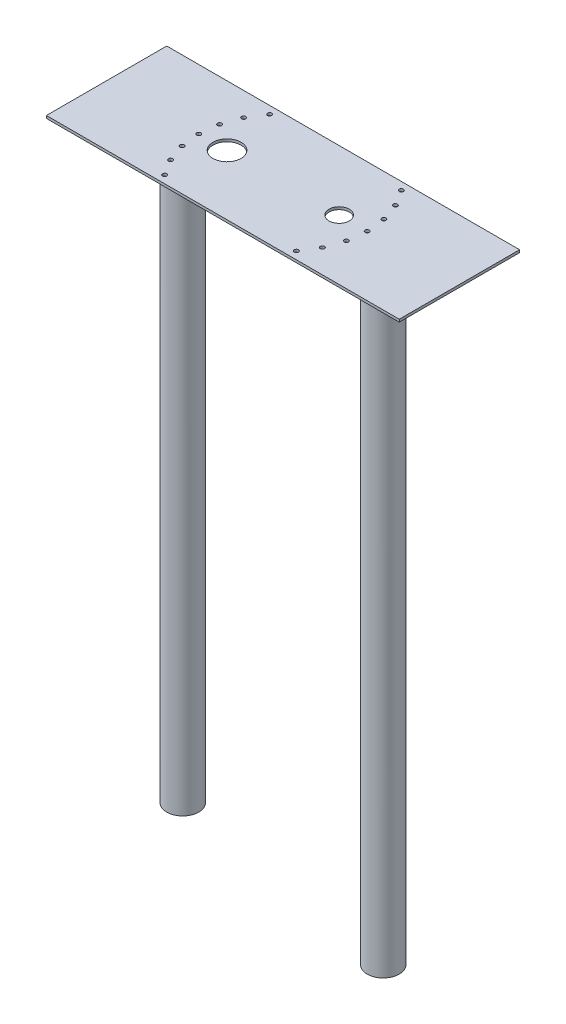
ISO-10303-21;
HEADER;
FILE_DESCRIPTION(('STEP AP214'),'2;1');
FILE_NAME('part.step','',(''),(''),'','','');
FILE_SCHEMA(('AUTOMOTIVE_DESIGN { 1 0 10303 214 1 1 1 1 }'));
ENDSEC;
DATA;
#1=APPLICATION_CONTEXT('core data for automotive mechanical design processes');
#2=APPLICATION_PROTOCOL_DEFINITION('international standard','automotive_design',2000,#1);
#3=PRODUCT_CONTEXT('',#1,'mechanical');
#4=PRODUCT('Part','Part','',(#3));
#5=PRODUCT_RELATED_PRODUCT_CATEGORY('part','',(#4));
#6=PRODUCT_DEFINITION_FORMATION('','',#4);
#7=PRODUCT_DEFINITION_CONTEXT('part definition',#1,'design');
#8=PRODUCT_DEFINITION('design','',#6,#7);
#9=PRODUCT_DEFINITION_SHAPE('','',#8);
#10=(LENGTH_UNIT() NAMED_UNIT(*) SI_UNIT(.MILLI.,.METRE.));
#11=(NAMED_UNIT(*) PLANE_ANGLE_UNIT() SI_UNIT($,.RADIAN.));
#12=(NAMED_UNIT(*) SI_UNIT($,.STERADIAN.) SOLID_ANGLE_UNIT());
#13=UNCERTAINTY_MEASURE_WITH_UNIT(LENGTH_MEASURE(1.E-05),#10,'distance_accuracy_value','');
#14=(GEOMETRIC_REPRESENTATION_CONTEXT(3) GLOBAL_UNCERTAINTY_ASSIGNED_CONTEXT((#13)) GLOBAL_UNIT_ASSIGNED_CONTEXT((#10,
#11,#12)) REPRESENTATION_CONTEXT('',''));
#15=CARTESIAN_POINT('',(0.,0.,0.));
#16=DIRECTION('',(0.,0.,1.));
#17=DIRECTION('',(1.,0.,0.));
#18=AXIS2_PLACEMENT_3D('',#15,#16,#17);
#19=CARTESIAN_POINT('',(0.,0.,0.));
#20=DIRECTION('',(0.,1.,0.));
#21=DIRECTION('',(0.,0.,1.));
#22=AXIS2_PLACEMENT_3D('',#19,#20,#21);
#23=PLANE('',#22);
#24=CARTESIAN_POINT('',(739.9,0.,-100.));
#25=DIRECTION('',(0.,1.,0.));
#26=DIRECTION('',(0.,0.,1.));
#27=AXIS2_PLACEMENT_3D('',#24,#25,#26);
#28=CIRCLE('',#27,40.);
#29=CARTESIAN_POINT('',(739.9,0.,-60.));
#30=VERTEX_POINT('',#29);
#31=EDGE_CURVE('E44',#30,#30,#28,.F.);
#32=ORIENTED_EDGE('',*,*,#31,.F.);
#33=EDGE_LOOP('',(#32));
#34=FACE_BOUND('',#33,.T.);
#35=CARTESIAN_POINT('',(235.215138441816,0.,-196.779396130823));
#36=DIRECTION('',(0.,1.,0.));
#37=DIRECTION('',(0.,0.,1.));
#38=AXIS2_PLACEMENT_3D('',#35,#36,#37);
#39=CIRCLE('',#38,5.25);
#40=CARTESIAN_POINT('',(235.215138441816,0.,-191.529396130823));
#41=VERTEX_POINT('',#40);
#42=EDGE_CURVE('E166',#41,#41,#39,.T.);
#43=ORIENTED_EDGE('',*,*,#42,.T.);
#44=EDGE_LOOP('',(#43));
#45=FACE_BOUND('',#44,.T.);
#46=CARTESIAN_POINT('',(250.746537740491,0.,-241.165585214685));
#47=DIRECTION('',(0.,1.,0.));
#48=DIRECTION('',(0.,0.,1.));
#49=AXIS2_PLACEMENT_3D('',#46,#47,#48);
#50=CIRCLE('',#49,5.25);
#51=CARTESIAN_POINT('',(250.746537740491,0.,-235.915585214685));
#52=VERTEX_POINT('',#51);
#53=EDGE_CURVE('E162',#52,#52,#50,.T.);
#54=ORIENTED_EDGE('',*,*,#53,.T.);
#55=EDGE_LOOP('',(#54));
#56=FACE_BOUND('',#55,.T.);
#57=CARTESIAN_POINT('',(275.765388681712,0.,-280.982858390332));
#58=DIRECTION('',(0.,1.,0.));
#59=DIRECTION('',(0.,0.,1.));
#60=AXIS2_PLACEMENT_3D('',#57,#58,#59);
#61=CIRCLE('',#60,5.25);
#62=CARTESIAN_POINT('',(275.765388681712,0.,-275.732858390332));
#63=VERTEX_POINT('',#62);
#64=EDGE_CURVE('E158',#63,#63,#61,.T.);
#65=ORIENTED_EDGE('',*,*,#64,.T.);
#66=EDGE_LOOP('',(#65));
#67=FACE_BOUND('',#66,.T.);
#68=CARTESIAN_POINT('',(604.134611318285,0.,-280.982858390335));
#69=DIRECTION('',(0.,1.,0.));
#70=DIRECTION('',(0.,0.,1.));
#71=AXIS2_PLACEMENT_3D('',#68,#69,#70);
#72=CIRCLE('',#71,5.25);
#73=CARTESIAN_POINT('',(604.134611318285,0.,-275.732858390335));
#74=VERTEX_POINT('',#73);
#75=EDGE_CURVE('E154',#74,#74,#72,.T.);
#76=ORIENTED_EDGE('',*,*,#75,.T.);
#77=EDGE_LOOP('',(#76));
#78=FACE_BOUND('',#77,.T.);
#79=CARTESIAN_POINT('',(629.153462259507,0.,-241.165585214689));
#80=DIRECTION('',(0.,1.,0.));
#81=DIRECTION('',(0.,0.,1.));
#82=AXIS2_PLACEMENT_3D('',#79,#80,#81);
#83=CIRCLE('',#82,5.25);
#84=CARTESIAN_POINT('',(629.153462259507,0.,-235.915585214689));
#85=VERTEX_POINT('',#84);
#86=EDGE_CURVE('E150',#85,#85,#83,.T.);
#87=ORIENTED_EDGE('',*,*,#86,.T.);
#88=EDGE_LOOP('',(#87));
#89=FACE_BOUND('',#88,.T.);
#90=CARTESIAN_POINT('',(644.684861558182,0.,-196.779396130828));
#91=DIRECTION('',(0.,1.,0.));
#92=DIRECTION('',(0.,0.,1.));
#93=AXIS2_PLACEMENT_3D('',#90,#91,#92);
#94=CIRCLE('',#93,5.25);
#95=CARTESIAN_POINT('',(644.684861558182,0.,-191.529396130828));
#96=VERTEX_POINT('',#95);
#97=EDGE_CURVE('E146',#96,#96,#94,.T.);
#98=ORIENTED_EDGE('',*,*,#97,.T.);
#99=EDGE_LOOP('',(#98));
#100=FACE_BOUND('',#99,.T.);
#101=CARTESIAN_POINT('',(649.95,0.,-150.05));
#102=DIRECTION('',(0.,1.,0.));
#103=DIRECTION('',(0.,0.,1.));
#104=AXIS2_PLACEMENT_3D('',#101,#102,#103);
#105=CIRCLE('',#104,5.25);
#106=CARTESIAN_POINT('',(649.95,0.,-144.8));
#107=VERTEX_POINT('',#106);
#108=EDGE_CURVE('E142',#107,#107,#105,.T.);
#109=ORIENTED_EDGE('',*,*,#108,.T.);
#110=EDGE_LOOP('',(#109));
#111=FACE_BOUND('',#110,.T.);
#112=CARTESIAN_POINT('',(644.684861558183,0.,-103.320603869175));
#113=DIRECTION('',(0.,1.,0.));
#114=DIRECTION('',(0.,0.,1.));
#115=AXIS2_PLACEMENT_3D('',#112,#113,#114);
#116=CIRCLE('',#115,5.25);
#117=CARTESIAN_POINT('',(644.684861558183,0.,-98.0706038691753));
#118=VERTEX_POINT('',#117);
#119=EDGE_CURVE('E138',#118,#118,#116,.T.);
#120=ORIENTED_EDGE('',*,*,#119,.T.);
#121=EDGE_LOOP('',(#120));
#122=FACE_BOUND('',#121,.T.);
#123=CARTESIAN_POINT('',(629.153462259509,0.,-58.934414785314));
#124=DIRECTION('',(0.,1.,0.));
#125=DIRECTION('',(0.,0.,1.));
#126=AXIS2_PLACEMENT_3D('',#123,#124,#125);
#127=CIRCLE('',#126,5.25);
#128=CARTESIAN_POINT('',(629.153462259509,0.,-53.684414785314));
#129=VERTEX_POINT('',#128);
#130=EDGE_CURVE('E134',#129,#129,#127,.T.);
#131=ORIENTED_EDGE('',*,*,#130,.T.);
#132=EDGE_LOOP('',(#131));
#133=FACE_BOUND('',#132,.T.);
#134=CARTESIAN_POINT('',(604.134611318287,0.,-19.1171416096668));
#135=DIRECTION('',(0.,1.,0.));
#136=DIRECTION('',(0.,0.,1.));
#137=AXIS2_PLACEMENT_3D('',#134,#135,#136);
#138=CIRCLE('',#137,5.25);
#139=CARTESIAN_POINT('',(604.134611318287,0.,-13.8671416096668));
#140=VERTEX_POINT('',#139);
#141=EDGE_CURVE('E130',#140,#140,#138,.T.);
#142=ORIENTED_EDGE('',*,*,#141,.T.);
#143=EDGE_LOOP('',(#142));
#144=FACE_BOUND('',#143,.T.);
#145=CARTESIAN_POINT('',(275.765388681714,0.,-19.1171416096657));
#146=DIRECTION('',(0.,1.,0.));
#147=DIRECTION('',(0.,0.,1.));
#148=AXIS2_PLACEMENT_3D('',#145,#146,#147);
#149=CIRCLE('',#148,5.25);
#150=CARTESIAN_POINT('',(275.765388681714,0.,-13.8671416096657));
#151=VERTEX_POINT('',#150);
#152=EDGE_CURVE('E126',#151,#151,#149,.T.);
#153=ORIENTED_EDGE('',*,*,#152,.T.);
#154=EDGE_LOOP('',(#153));
#155=FACE_BOUND('',#154,.T.);
#156=CARTESIAN_POINT('',(250.746537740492,0.,-58.9344147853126));
#157=DIRECTION('',(0.,1.,0.));
#158=DIRECTION('',(0.,0.,1.));
#159=AXIS2_PLACEMENT_3D('',#156,#157,#158);
#160=CIRCLE('',#159,5.25);
#161=CARTESIAN_POINT('',(250.746537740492,0.,-53.6844147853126));
#162=VERTEX_POINT('',#161);
#163=EDGE_CURVE('E122',#162,#162,#160,.T.);
#164=ORIENTED_EDGE('',*,*,#163,.T.);
#165=EDGE_LOOP('',(#164));
#166=FACE_BOUND('',#165,.T.);
#167=CARTESIAN_POINT('',(235.215138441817,0.,-103.320603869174));
#168=DIRECTION('',(0.,1.,0.));
#169=DIRECTION('',(0.,0.,1.));
#170=AXIS2_PLACEMENT_3D('',#167,#168,#169);
#171=CIRCLE('',#170,5.25);
#172=CARTESIAN_POINT('',(235.215138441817,0.,-98.0706038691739));
#173=VERTEX_POINT('',#172);
#174=EDGE_CURVE('E118',#173,#173,#171,.T.);
#175=ORIENTED_EDGE('',*,*,#174,.T.);
#176=EDGE_LOOP('',(#175));
#177=FACE_BOUND('',#176,.T.);
#178=CARTESIAN_POINT('',(229.95,0.,-150.05));
#179=DIRECTION('',(0.,1.,0.));
#180=DIRECTION('',(0.,0.,1.));
#181=AXIS2_PLACEMENT_3D('',#178,#179,#180);
#182=CIRCLE('',#181,5.25);
#183=CARTESIAN_POINT('',(229.95,0.,-144.8));
#184=VERTEX_POINT('',#183);
#185=EDGE_CURVE('E113',#184,#184,#182,.T.);
#186=ORIENTED_EDGE('',*,*,#185,.T.);
#187=EDGE_LOOP('',(#186));
#188=FACE_BOUND('',#187,.T.);
#189=CARTESIAN_POINT('',(580.,0.,-150.));
#190=DIRECTION('',(0.,1.,0.));
#191=DIRECTION('',(0.,0.,1.));
#192=AXIS2_PLACEMENT_3D('',#189,#190,#191);
#193=CIRCLE('',#192,25.4);
#194=CARTESIAN_POINT('',(580.,0.,-124.6));
#195=VERTEX_POINT('',#194);
#196=EDGE_CURVE('E208',#195,#195,#193,.T.);
#197=ORIENTED_EDGE('',*,*,#196,.T.);
#198=EDGE_LOOP('',(#197));
#199=FACE_BOUND('',#198,.T.);
#200=CARTESIAN_POINT('',(300.4,0.,-150.));
#201=DIRECTION('',(0.,1.,0.));
#202=DIRECTION('',(0.,0.,1.));
#203=AXIS2_PLACEMENT_3D('',#200,#201,#202);
#204=CIRCLE('',#203,35.);
#205=CARTESIAN_POINT('',(300.4,0.,-115.));
#206=VERTEX_POINT('',#205);
#207=EDGE_CURVE('E106',#206,#206,#204,.T.);
#208=ORIENTED_EDGE('',*,*,#207,.T.);
#209=EDGE_LOOP('',(#208));
#210=FACE_BOUND('',#209,.T.);
#211=DIRECTION('',(0.,0.,1.));
#212=VECTOR('',#211,1.);
#213=CARTESIAN_POINT('',(0.,0.,-300.1));
#214=LINE('',#213,#212);
#215=CARTESIAN_POINT('',(0.,0.,-300.1));
#216=VERTEX_POINT('',#215);
#217=CARTESIAN_POINT('',(0.,0.,0.));
#218=VERTEX_POINT('',#217);
#219=EDGE_CURVE('E103',#216,#218,#214,.T.);
#220=ORIENTED_EDGE('',*,*,#219,.F.);
#221=DIRECTION('',(-1.,0.,0.));
#222=VECTOR('',#221,1.);
#223=CARTESIAN_POINT('',(879.9,0.,-300.1));
#224=LINE('',#223,#222);
#225=CARTESIAN_POINT('',(879.9,0.,-300.1));
#226=VERTEX_POINT('',#225);
#227=EDGE_CURVE('E75',#226,#216,#224,.T.);
#228=ORIENTED_EDGE('',*,*,#227,.F.);
#229=DIRECTION('',(0.,0.,-1.));
#230=VECTOR('',#229,1.);
#231=CARTESIAN_POINT('',(879.9,0.,0.));
#232=LINE('',#231,#230);
#233=CARTESIAN_POINT('',(879.9,0.,0.));
#234=VERTEX_POINT('',#233);
#235=EDGE_CURVE('E69',#234,#226,#232,.T.);
#236=ORIENTED_EDGE('',*,*,#235,.F.);
#237=DIRECTION('',(1.,0.,0.));
#238=VECTOR('',#237,1.);
#239=CARTESIAN_POINT('',(0.,0.,0.));
#240=LINE('',#239,#238);
#241=EDGE_CURVE('E93',#218,#234,#240,.T.);
#242=ORIENTED_EDGE('',*,*,#241,.F.);
#243=EDGE_LOOP('',(#220,#228,#236,#242));
#244=FACE_BOUND('',#243,.T.);
#245=CARTESIAN_POINT('',(140.,0.,-200.));
#246=DIRECTION('',(0.,1.,0.));
#247=DIRECTION('',(0.,0.,1.));
#248=AXIS2_PLACEMENT_3D('',#245,#246,#247);
#249=CIRCLE('',#248,40.);
#250=CARTESIAN_POINT('',(140.,0.,-160.));
#251=VERTEX_POINT('',#250);
#252=EDGE_CURVE('E11',#251,#251,#249,.F.);
#253=ORIENTED_EDGE('',*,*,#252,.F.);
#254=EDGE_LOOP('',(#253));
#255=FACE_BOUND('',#254,.T.);
#256=ADVANCED_FACE('F35',(#34,#45,#56,#67,#78,#89,#100,#111,#122,#133,#144,#155,#166,#177,#188,
#199,#210,#244,#255),#23,.F.);
#257=CARTESIAN_POINT('',(0.,6.4,-300.1));
#258=DIRECTION('',(1.,0.,0.));
#259=DIRECTION('',(0.,0.,-1.));
#260=AXIS2_PLACEMENT_3D('',#257,#258,#259);
#261=PLANE('',#260);
#262=ORIENTED_EDGE('',*,*,#219,.T.);
#263=DIRECTION('',(0.,-1.,0.));
#264=VECTOR('',#263,1.);
#265=CARTESIAN_POINT('',(0.,6.4,0.));
#266=LINE('',#265,#264);
#267=CARTESIAN_POINT('',(0.,6.4,0.));
#268=VERTEX_POINT('',#267);
#269=EDGE_CURVE('E94',#268,#218,#266,.T.);
#270=ORIENTED_EDGE('',*,*,#269,.F.);
#271=DIRECTION('',(0.,0.,1.));
#272=VECTOR('',#271,1.);
#273=CARTESIAN_POINT('',(0.,6.4,-300.1));
#274=LINE('',#273,#272);
#275=CARTESIAN_POINT('',(0.,6.4,-300.1));
#276=VERTEX_POINT('',#275);
#277=EDGE_CURVE('E88',#276,#268,#274,.T.);
#278=ORIENTED_EDGE('',*,*,#277,.F.);
#279=DIRECTION('',(0.,-1.,0.));
#280=VECTOR('',#279,1.);
#281=CARTESIAN_POINT('',(0.,6.4,-300.1));
#282=LINE('',#281,#280);
#283=EDGE_CURVE('E99',#276,#216,#282,.T.);
#284=ORIENTED_EDGE('',*,*,#283,.T.);
#285=EDGE_LOOP('',(#262,#270,#278,#284));
#286=FACE_BOUND('',#285,.T.);
#287=ADVANCED_FACE('F37',(#286),#261,.F.);
#288=CARTESIAN_POINT('',(0.,6.4,0.));
#289=DIRECTION('',(0.,0.,-1.));
#290=DIRECTION('',(-1.,0.,0.));
#291=AXIS2_PLACEMENT_3D('',#288,#289,#290);
#292=PLANE('',#291);
#293=ORIENTED_EDGE('',*,*,#241,.T.);
#294=DIRECTION('',(0.,-1.,0.));
#295=VECTOR('',#294,1.);
#296=CARTESIAN_POINT('',(879.9,6.4,0.));
#297=LINE('',#296,#295);
#298=CARTESIAN_POINT('',(879.9,6.4,0.));
#299=VERTEX_POINT('',#298);
#300=EDGE_CURVE('E91',#299,#234,#297,.T.);
#301=ORIENTED_EDGE('',*,*,#300,.F.);
#302=DIRECTION('',(1.,0.,0.));
#303=VECTOR('',#302,1.);
#304=CARTESIAN_POINT('',(0.,6.4,0.));
#305=LINE('',#304,#303);
#306=EDGE_CURVE('E83',#268,#299,#305,.T.);
#307=ORIENTED_EDGE('',*,*,#306,.F.);
#308=ORIENTED_EDGE('',*,*,#269,.T.);
#309=EDGE_LOOP('',(#293,#301,#307,#308));
#310=FACE_BOUND('',#309,.T.);
#311=ADVANCED_FACE('F92',(#310),#292,.F.);
#312=CARTESIAN_POINT('',(879.9,6.4,0.));
#313=DIRECTION('',(-1.,0.,0.));
#314=DIRECTION('',(0.,0.,1.));
#315=AXIS2_PLACEMENT_3D('',#312,#313,#314);
#316=PLANE('',#315);
#317=ORIENTED_EDGE('',*,*,#235,.T.);
#318=DIRECTION('',(0.,-1.,0.));
#319=VECTOR('',#318,1.);
#320=CARTESIAN_POINT('',(879.9,6.4,-300.1));
#321=LINE('',#320,#319);
#322=CARTESIAN_POINT('',(879.9,6.4,-300.1));
#323=VERTEX_POINT('',#322);
#324=EDGE_CURVE('E95',#323,#226,#321,.T.);
#325=ORIENTED_EDGE('',*,*,#324,.F.);
#326=DIRECTION('',(0.,0.,-1.));
#327=VECTOR('',#326,1.);
#328=CARTESIAN_POINT('',(879.9,6.4,0.));
#329=LINE('',#328,#327);
#330=EDGE_CURVE('E86',#299,#323,#329,.T.);
#331=ORIENTED_EDGE('',*,*,#330,.F.);
#332=ORIENTED_EDGE('',*,*,#300,.T.);
#333=EDGE_LOOP('',(#317,#325,#331,#332));
#334=FACE_BOUND('',#333,.T.);
#335=ADVANCED_FACE('F97',(#334),#316,.F.);
#336=CARTESIAN_POINT('',(879.9,6.4,-300.1));
#337=DIRECTION('',(0.,0.,1.));
#338=DIRECTION('',(1.,0.,0.));
#339=AXIS2_PLACEMENT_3D('',#336,#337,#338);
#340=PLANE('',#339);
#341=ORIENTED_EDGE('',*,*,#227,.T.);
#342=ORIENTED_EDGE('',*,*,#283,.F.);
#343=DIRECTION('',(-1.,0.,0.));
#344=VECTOR('',#343,1.);
#345=CARTESIAN_POINT('',(879.9,6.4,-300.1));
#346=LINE('',#345,#344);
#347=EDGE_CURVE('E52',#323,#276,#346,.T.);
#348=ORIENTED_EDGE('',*,*,#347,.F.);
#349=ORIENTED_EDGE('',*,*,#324,.T.);
#350=EDGE_LOOP('',(#341,#342,#348,#349));
#351=FACE_BOUND('',#350,.T.);
#352=ADVANCED_FACE('F300',(#351),#340,.F.);
#353=CARTESIAN_POINT('',(0.,6.4,0.));
#354=DIRECTION('',(0.,1.,0.));
#355=DIRECTION('',(0.,0.,1.));
#356=AXIS2_PLACEMENT_3D('',#353,#354,#355);
#357=PLANE('',#356);
#358=CARTESIAN_POINT('',(235.215138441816,6.4,-196.779396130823));
#359=DIRECTION('',(0.,1.,0.));
#360=DIRECTION('',(-0.222520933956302,0.,0.974927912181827));
#361=AXIS2_PLACEMENT_3D('',#358,#359,#360);
#362=CIRCLE('',#361,5.25);
#363=CARTESIAN_POINT('',(234.046903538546,6.4,-191.661024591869));
#364=VERTEX_POINT('',#363);
#365=EDGE_CURVE('E168',#364,#364,#362,.T.);
#366=ORIENTED_EDGE('',*,*,#365,.F.);
#367=EDGE_LOOP('',(#366));
#368=FACE_BOUND('',#367,.T.);
#369=CARTESIAN_POINT('',(250.746537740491,6.4,-241.165585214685));
#370=DIRECTION('',(0.,1.,0.));
#371=DIRECTION('',(-0.433883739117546,0.,0.900968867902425));
#372=AXIS2_PLACEMENT_3D('',#369,#370,#371);
#373=CIRCLE('',#372,5.25);
#374=CARTESIAN_POINT('',(248.468648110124,6.4,-236.435498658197));
#375=VERTEX_POINT('',#374);
#376=EDGE_CURVE('E165',#375,#375,#373,.T.);
#377=ORIENTED_EDGE('',*,*,#376,.F.);
#378=EDGE_LOOP('',(#377));
#379=FACE_BOUND('',#378,.T.);
#380=CARTESIAN_POINT('',(275.765388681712,6.4,-280.982858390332));
#381=DIRECTION('',(0.,1.,0.));
#382=DIRECTION('',(-0.623489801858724,0.,0.781831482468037));
#383=AXIS2_PLACEMENT_3D('',#380,#381,#382);
#384=CIRCLE('',#383,5.25);
#385=CARTESIAN_POINT('',(272.492067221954,6.4,-276.878243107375));
#386=VERTEX_POINT('',#385);
#387=EDGE_CURVE('E161',#386,#386,#384,.T.);
#388=ORIENTED_EDGE('',*,*,#387,.F.);
#389=EDGE_LOOP('',(#388));
#390=FACE_BOUND('',#389,.T.);
#391=CARTESIAN_POINT('',(604.134611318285,6.4,-280.982858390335));
#392=DIRECTION('',(0.,1.,0.));
#393=DIRECTION('',(-0.62348980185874,0.,-0.781831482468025));
#394=AXIS2_PLACEMENT_3D('',#391,#392,#393);
#395=CIRCLE('',#394,5.25);
#396=CARTESIAN_POINT('',(600.861289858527,6.4,-285.087473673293));
#397=VERTEX_POINT('',#396);
#398=EDGE_CURVE('E157',#397,#397,#395,.T.);
#399=ORIENTED_EDGE('',*,*,#398,.F.);
#400=EDGE_LOOP('',(#399));
#401=FACE_BOUND('',#400,.T.);
#402=CARTESIAN_POINT('',(629.153462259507,6.4,-241.165585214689));
#403=DIRECTION('',(0.,1.,0.));
#404=DIRECTION('',(-0.433883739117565,0.,-0.900968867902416));
#405=AXIS2_PLACEMENT_3D('',#402,#403,#404);
#406=CIRCLE('',#405,5.25);
#407=CARTESIAN_POINT('',(626.87557262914,6.4,-245.895671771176));
#408=VERTEX_POINT('',#407);
#409=EDGE_CURVE('E153',#408,#408,#406,.T.);
#410=ORIENTED_EDGE('',*,*,#409,.F.);
#411=EDGE_LOOP('',(#410));
#412=FACE_BOUND('',#411,.T.);
#413=CARTESIAN_POINT('',(644.684861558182,6.4,-196.779396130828));
#414=DIRECTION('',(0.,1.,0.));
#415=DIRECTION('',(-0.222520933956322,0.,-0.974927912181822));
#416=AXIS2_PLACEMENT_3D('',#413,#414,#415);
#417=CIRCLE('',#416,5.25);
#418=CARTESIAN_POINT('',(643.516626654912,6.4,-201.897767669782));
#419=VERTEX_POINT('',#418);
#420=EDGE_CURVE('E149',#419,#419,#417,.T.);
#421=ORIENTED_EDGE('',*,*,#420,.F.);
#422=EDGE_LOOP('',(#421));
#423=FACE_BOUND('',#422,.T.);
#424=CARTESIAN_POINT('',(649.95,6.4,-150.05));
#425=DIRECTION('',(0.,1.,0.));
#426=DIRECTION('',(0.,0.,-1.));
#427=AXIS2_PLACEMENT_3D('',#424,#425,#426);
#428=CIRCLE('',#427,5.25);
#429=CARTESIAN_POINT('',(649.95,6.4,-155.3));
#430=VERTEX_POINT('',#429);
#431=EDGE_CURVE('E145',#430,#430,#428,.T.);
#432=ORIENTED_EDGE('',*,*,#431,.F.);
#433=EDGE_LOOP('',(#432));
#434=FACE_BOUND('',#433,.T.);
#435=CARTESIAN_POINT('',(644.684861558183,6.4,-103.320603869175));
#436=DIRECTION('',(0.,1.,0.));
#437=DIRECTION('',(0.222520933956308,0.,-0.974927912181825));
#438=AXIS2_PLACEMENT_3D('',#435,#436,#437);
#439=CIRCLE('',#438,5.25);
#440=CARTESIAN_POINT('',(645.853096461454,6.4,-108.43897540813));
#441=VERTEX_POINT('',#440);
#442=EDGE_CURVE('E141',#441,#441,#439,.T.);
#443=ORIENTED_EDGE('',*,*,#442,.F.);
#444=EDGE_LOOP('',(#443));
#445=FACE_BOUND('',#444,.T.);
#446=CARTESIAN_POINT('',(629.153462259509,6.4,-58.934414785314));
#447=DIRECTION('',(0.,1.,0.));
#448=DIRECTION('',(0.433883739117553,0.,-0.900968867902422));
#449=AXIS2_PLACEMENT_3D('',#446,#447,#448);
#450=CIRCLE('',#449,5.25);
#451=CARTESIAN_POINT('',(631.431351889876,6.4,-63.6645013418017));
#452=VERTEX_POINT('',#451);
#453=EDGE_CURVE('E137',#452,#452,#450,.T.);
#454=ORIENTED_EDGE('',*,*,#453,.F.);
#455=EDGE_LOOP('',(#454));
#456=FACE_BOUND('',#455,.T.);
#457=CARTESIAN_POINT('',(604.134611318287,6.4,-19.1171416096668));
#458=DIRECTION('',(0.,1.,0.));
#459=DIRECTION('',(0.623489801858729,0.,-0.781831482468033));
#460=AXIS2_PLACEMENT_3D('',#457,#458,#459);
#461=CIRCLE('',#460,5.25);
#462=CARTESIAN_POINT('',(607.407932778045,6.4,-23.221756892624));
#463=VERTEX_POINT('',#462);
#464=EDGE_CURVE('E133',#463,#463,#461,.T.);
#465=ORIENTED_EDGE('',*,*,#464,.F.);
#466=EDGE_LOOP('',(#465));
#467=FACE_BOUND('',#466,.T.);
#468=CARTESIAN_POINT('',(275.765388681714,6.4,-19.1171416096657));
#469=DIRECTION('',(0.,1.,0.));
#470=DIRECTION('',(0.623489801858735,0.,0.781831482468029));
#471=AXIS2_PLACEMENT_3D('',#468,#469,#470);
#472=CIRCLE('',#471,5.25);
#473=CARTESIAN_POINT('',(279.038710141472,6.4,-15.0125263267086));
#474=VERTEX_POINT('',#473);
#475=EDGE_CURVE('E129',#474,#474,#472,.T.);
#476=ORIENTED_EDGE('',*,*,#475,.F.);
#477=EDGE_LOOP('',(#476));
#478=FACE_BOUND('',#477,.T.);
#479=CARTESIAN_POINT('',(250.746537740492,6.4,-58.9344147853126));
#480=DIRECTION('',(0.,1.,0.));
#481=DIRECTION('',(0.433883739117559,0.,0.900968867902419));
#482=AXIS2_PLACEMENT_3D('',#479,#480,#481);
#483=CIRCLE('',#482,5.25);
#484=CARTESIAN_POINT('',(253.024427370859,6.4,-54.2043282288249));
#485=VERTEX_POINT('',#484);
#486=EDGE_CURVE('E125',#485,#485,#483,.T.);
#487=ORIENTED_EDGE('',*,*,#486,.F.);
#488=EDGE_LOOP('',(#487));
#489=FACE_BOUND('',#488,.T.);
#490=CARTESIAN_POINT('',(235.215138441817,6.4,-103.320603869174));
#491=DIRECTION('',(0.,1.,0.));
#492=DIRECTION('',(0.222520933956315,0.,0.974927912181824));
#493=AXIS2_PLACEMENT_3D('',#490,#491,#492);
#494=CIRCLE('',#493,5.25);
#495=CARTESIAN_POINT('',(236.383373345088,6.4,-98.2022323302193));
#496=VERTEX_POINT('',#495);
#497=EDGE_CURVE('E121',#496,#496,#494,.T.);
#498=ORIENTED_EDGE('',*,*,#497,.F.);
#499=EDGE_LOOP('',(#498));
#500=FACE_BOUND('',#499,.T.);
#501=CARTESIAN_POINT('',(229.95,6.4,-150.05));
#502=DIRECTION('',(0.,1.,0.));
#503=DIRECTION('',(0.,0.,1.));
#504=AXIS2_PLACEMENT_3D('',#501,#502,#503);
#505=CIRCLE('',#504,5.25);
#506=CARTESIAN_POINT('',(229.95,6.4,-144.8));
#507=VERTEX_POINT('',#506);
#508=EDGE_CURVE('E117',#507,#507,#505,.T.);
#509=ORIENTED_EDGE('',*,*,#508,.F.);
#510=EDGE_LOOP('',(#509));
#511=FACE_BOUND('',#510,.T.);
#512=CARTESIAN_POINT('',(580.,6.4,-150.));
#513=DIRECTION('',(0.,1.,0.));
#514=DIRECTION('',(0.,0.,1.));
#515=AXIS2_PLACEMENT_3D('',#512,#513,#514);
#516=CIRCLE('',#515,25.4);
#517=CARTESIAN_POINT('',(580.,6.4,-124.6));
#518=VERTEX_POINT('',#517);
#519=EDGE_CURVE('E116',#518,#518,#516,.T.);
#520=ORIENTED_EDGE('',*,*,#519,.F.);
#521=EDGE_LOOP('',(#520));
#522=FACE_BOUND('',#521,.T.);
#523=CARTESIAN_POINT('',(300.4,6.4,-150.));
#524=DIRECTION('',(0.,1.,0.));
#525=DIRECTION('',(0.,0.,1.));
#526=AXIS2_PLACEMENT_3D('',#523,#524,#525);
#527=CIRCLE('',#526,35.);
#528=CARTESIAN_POINT('',(300.4,6.4,-115.));
#529=VERTEX_POINT('',#528);
#530=EDGE_CURVE('E314',#529,#529,#527,.T.);
#531=ORIENTED_EDGE('',*,*,#530,.F.);
#532=EDGE_LOOP('',(#531));
#533=FACE_BOUND('',#532,.T.);
#534=ORIENTED_EDGE('',*,*,#277,.T.);
#535=ORIENTED_EDGE('',*,*,#306,.T.);
#536=ORIENTED_EDGE('',*,*,#330,.T.);
#537=ORIENTED_EDGE('',*,*,#347,.T.);
#538=EDGE_LOOP('',(#534,#535,#536,#537));
#539=FACE_BOUND('',#538,.T.);
#540=ADVANCED_FACE('F84',(#368,#379,#390,#401,#412,#423,#434,#445,#456,#467,#478,#489,#500,#511,
#522,#533,#539),#357,.T.);
#541=CARTESIAN_POINT('',(300.4,0.,-150.));
#542=DIRECTION('',(0.,1.,0.));
#543=DIRECTION('',(0.,0.,1.));
#544=AXIS2_PLACEMENT_3D('',#541,#542,#543);
#545=CYLINDRICAL_SURFACE('',#544,35.);
#546=ORIENTED_EDGE('',*,*,#207,.F.);
#547=EDGE_LOOP('',(#546));
#548=FACE_BOUND('',#547,.T.);
#549=ORIENTED_EDGE('',*,*,#530,.T.);
#550=EDGE_LOOP('',(#549));
#551=FACE_BOUND('',#550,.T.);
#552=ADVANCED_FACE('F294',(#548,#551),#545,.F.);
#553=CARTESIAN_POINT('',(580.,0.,-150.));
#554=DIRECTION('',(0.,1.,0.));
#555=DIRECTION('',(0.,0.,1.));
#556=AXIS2_PLACEMENT_3D('',#553,#554,#555);
#557=CYLINDRICAL_SURFACE('',#556,25.4);
#558=ORIENTED_EDGE('',*,*,#196,.F.);
#559=EDGE_LOOP('',(#558));
#560=FACE_BOUND('',#559,.T.);
#561=ORIENTED_EDGE('',*,*,#519,.T.);
#562=EDGE_LOOP('',(#561));
#563=FACE_BOUND('',#562,.T.);
#564=ADVANCED_FACE('F290',(#560,#563),#557,.F.);
#565=CARTESIAN_POINT('',(229.95,-3.6,-150.05));
#566=DIRECTION('',(0.,1.,0.));
#567=DIRECTION('',(0.,0.,1.));
#568=AXIS2_PLACEMENT_3D('',#565,#566,#567);
#569=CYLINDRICAL_SURFACE('',#568,5.25);
#570=ORIENTED_EDGE('',*,*,#508,.T.);
#571=EDGE_LOOP('',(#570));
#572=FACE_BOUND('',#571,.T.);
#573=ORIENTED_EDGE('',*,*,#185,.F.);
#574=EDGE_LOOP('',(#573));
#575=FACE_BOUND('',#574,.T.);
#576=ADVANCED_FACE('F286',(#572,#575),#569,.F.);
#577=CARTESIAN_POINT('',(235.215138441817,-3.6,-103.320603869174));
#578=DIRECTION('',(0.,1.,0.));
#579=DIRECTION('',(0.,0.,1.));
#580=AXIS2_PLACEMENT_3D('',#577,#578,#579);
#581=CYLINDRICAL_SURFACE('',#580,5.25);
#582=ORIENTED_EDGE('',*,*,#497,.T.);
#583=EDGE_LOOP('',(#582));
#584=FACE_BOUND('',#583,.T.);
#585=ORIENTED_EDGE('',*,*,#174,.F.);
#586=EDGE_LOOP('',(#585));
#587=FACE_BOUND('',#586,.T.);
#588=ADVANCED_FACE('F282',(#584,#587),#581,.F.);
#589=CARTESIAN_POINT('',(250.746537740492,-3.6,-58.9344147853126));
#590=DIRECTION('',(0.,1.,0.));
#591=DIRECTION('',(0.,0.,1.));
#592=AXIS2_PLACEMENT_3D('',#589,#590,#591);
#593=CYLINDRICAL_SURFACE('',#592,5.25);
#594=ORIENTED_EDGE('',*,*,#486,.T.);
#595=EDGE_LOOP('',(#594));
#596=FACE_BOUND('',#595,.T.);
#597=ORIENTED_EDGE('',*,*,#163,.F.);
#598=EDGE_LOOP('',(#597));
#599=FACE_BOUND('',#598,.T.);
#600=ADVANCED_FACE('F278',(#596,#599),#593,.F.);
#601=CARTESIAN_POINT('',(275.765388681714,-3.6,-19.1171416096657));
#602=DIRECTION('',(0.,1.,0.));
#603=DIRECTION('',(0.,0.,1.));
#604=AXIS2_PLACEMENT_3D('',#601,#602,#603);
#605=CYLINDRICAL_SURFACE('',#604,5.25);
#606=ORIENTED_EDGE('',*,*,#475,.T.);
#607=EDGE_LOOP('',(#606));
#608=FACE_BOUND('',#607,.T.);
#609=ORIENTED_EDGE('',*,*,#152,.F.);
#610=EDGE_LOOP('',(#609));
#611=FACE_BOUND('',#610,.T.);
#612=ADVANCED_FACE('F274',(#608,#611),#605,.F.);
#613=CARTESIAN_POINT('',(604.134611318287,-3.6,-19.1171416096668));
#614=DIRECTION('',(0.,1.,0.));
#615=DIRECTION('',(0.,0.,1.));
#616=AXIS2_PLACEMENT_3D('',#613,#614,#615);
#617=CYLINDRICAL_SURFACE('',#616,5.25);
#618=ORIENTED_EDGE('',*,*,#464,.T.);
#619=EDGE_LOOP('',(#618));
#620=FACE_BOUND('',#619,.T.);
#621=ORIENTED_EDGE('',*,*,#141,.F.);
#622=EDGE_LOOP('',(#621));
#623=FACE_BOUND('',#622,.T.);
#624=ADVANCED_FACE('F270',(#620,#623),#617,.F.);
#625=CARTESIAN_POINT('',(629.153462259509,-3.6,-58.934414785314));
#626=DIRECTION('',(0.,1.,0.));
#627=DIRECTION('',(0.,0.,1.));
#628=AXIS2_PLACEMENT_3D('',#625,#626,#627);
#629=CYLINDRICAL_SURFACE('',#628,5.25);
#630=ORIENTED_EDGE('',*,*,#453,.T.);
#631=EDGE_LOOP('',(#630));
#632=FACE_BOUND('',#631,.T.);
#633=ORIENTED_EDGE('',*,*,#130,.F.);
#634=EDGE_LOOP('',(#633));
#635=FACE_BOUND('',#634,.T.);
#636=ADVANCED_FACE('F266',(#632,#635),#629,.F.);
#637=CARTESIAN_POINT('',(644.684861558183,-3.6,-103.320603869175));
#638=DIRECTION('',(0.,1.,0.));
#639=DIRECTION('',(0.,0.,1.));
#640=AXIS2_PLACEMENT_3D('',#637,#638,#639);
#641=CYLINDRICAL_SURFACE('',#640,5.25);
#642=ORIENTED_EDGE('',*,*,#442,.T.);
#643=EDGE_LOOP('',(#642));
#644=FACE_BOUND('',#643,.T.);
#645=ORIENTED_EDGE('',*,*,#119,.F.);
#646=EDGE_LOOP('',(#645));
#647=FACE_BOUND('',#646,.T.);
#648=ADVANCED_FACE('F262',(#644,#647),#641,.F.);
#649=CARTESIAN_POINT('',(649.95,-3.6,-150.05));
#650=DIRECTION('',(0.,1.,0.));
#651=DIRECTION('',(0.,0.,1.));
#652=AXIS2_PLACEMENT_3D('',#649,#650,#651);
#653=CYLINDRICAL_SURFACE('',#652,5.25);
#654=ORIENTED_EDGE('',*,*,#431,.T.);
#655=EDGE_LOOP('',(#654));
#656=FACE_BOUND('',#655,.T.);
#657=ORIENTED_EDGE('',*,*,#108,.F.);
#658=EDGE_LOOP('',(#657));
#659=FACE_BOUND('',#658,.T.);
#660=ADVANCED_FACE('F258',(#656,#659),#653,.F.);
#661=CARTESIAN_POINT('',(644.684861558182,-3.6,-196.779396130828));
#662=DIRECTION('',(0.,1.,0.));
#663=DIRECTION('',(0.,0.,1.));
#664=AXIS2_PLACEMENT_3D('',#661,#662,#663);
#665=CYLINDRICAL_SURFACE('',#664,5.25);
#666=ORIENTED_EDGE('',*,*,#420,.T.);
#667=EDGE_LOOP('',(#666));
#668=FACE_BOUND('',#667,.T.);
#669=ORIENTED_EDGE('',*,*,#97,.F.);
#670=EDGE_LOOP('',(#669));
#671=FACE_BOUND('',#670,.T.);
#672=ADVANCED_FACE('F254',(#668,#671),#665,.F.);
#673=CARTESIAN_POINT('',(629.153462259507,-3.6,-241.165585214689));
#674=DIRECTION('',(0.,1.,0.));
#675=DIRECTION('',(0.,0.,1.));
#676=AXIS2_PLACEMENT_3D('',#673,#674,#675);
#677=CYLINDRICAL_SURFACE('',#676,5.25);
#678=ORIENTED_EDGE('',*,*,#409,.T.);
#679=EDGE_LOOP('',(#678));
#680=FACE_BOUND('',#679,.T.);
#681=ORIENTED_EDGE('',*,*,#86,.F.);
#682=EDGE_LOOP('',(#681));
#683=FACE_BOUND('',#682,.T.);
#684=ADVANCED_FACE('F250',(#680,#683),#677,.F.);
#685=CARTESIAN_POINT('',(604.134611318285,-3.6,-280.982858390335));
#686=DIRECTION('',(0.,1.,0.));
#687=DIRECTION('',(0.,0.,1.));
#688=AXIS2_PLACEMENT_3D('',#685,#686,#687);
#689=CYLINDRICAL_SURFACE('',#688,5.25);
#690=ORIENTED_EDGE('',*,*,#398,.T.);
#691=EDGE_LOOP('',(#690));
#692=FACE_BOUND('',#691,.T.);
#693=ORIENTED_EDGE('',*,*,#75,.F.);
#694=EDGE_LOOP('',(#693));
#695=FACE_BOUND('',#694,.T.);
#696=ADVANCED_FACE('F246',(#692,#695),#689,.F.);
#697=CARTESIAN_POINT('',(275.765388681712,-3.6,-280.982858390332));
#698=DIRECTION('',(0.,1.,0.));
#699=DIRECTION('',(0.,0.,1.));
#700=AXIS2_PLACEMENT_3D('',#697,#698,#699);
#701=CYLINDRICAL_SURFACE('',#700,5.25);
#702=ORIENTED_EDGE('',*,*,#387,.T.);
#703=EDGE_LOOP('',(#702));
#704=FACE_BOUND('',#703,.T.);
#705=ORIENTED_EDGE('',*,*,#64,.F.);
#706=EDGE_LOOP('',(#705));
#707=FACE_BOUND('',#706,.T.);
#708=ADVANCED_FACE('F242',(#704,#707),#701,.F.);
#709=CARTESIAN_POINT('',(250.746537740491,-3.6,-241.165585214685));
#710=DIRECTION('',(0.,1.,0.));
#711=DIRECTION('',(0.,0.,1.));
#712=AXIS2_PLACEMENT_3D('',#709,#710,#711);
#713=CYLINDRICAL_SURFACE('',#712,5.25);
#714=ORIENTED_EDGE('',*,*,#376,.T.);
#715=EDGE_LOOP('',(#714));
#716=FACE_BOUND('',#715,.T.);
#717=ORIENTED_EDGE('',*,*,#53,.F.);
#718=EDGE_LOOP('',(#717));
#719=FACE_BOUND('',#718,.T.);
#720=ADVANCED_FACE('F238',(#716,#719),#713,.F.);
#721=CARTESIAN_POINT('',(235.215138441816,-3.6,-196.779396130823));
#722=DIRECTION('',(0.,1.,0.));
#723=DIRECTION('',(0.,0.,1.));
#724=AXIS2_PLACEMENT_3D('',#721,#722,#723);
#725=CYLINDRICAL_SURFACE('',#724,5.25);
#726=ORIENTED_EDGE('',*,*,#365,.T.);
#727=EDGE_LOOP('',(#726));
#728=FACE_BOUND('',#727,.T.);
#729=ORIENTED_EDGE('',*,*,#42,.F.);
#730=EDGE_LOOP('',(#729));
#731=FACE_BOUND('',#730,.T.);
#732=ADVANCED_FACE('F234',(#728,#731),#725,.F.);
#733=CARTESIAN_POINT('',(739.9,-1508.,-100.));
#734=DIRECTION('',(0.,1.,0.));
#735=DIRECTION('',(0.,0.,1.));
#736=AXIS2_PLACEMENT_3D('',#733,#734,#735);
#737=CYLINDRICAL_SURFACE('',#736,40.);
#738=CARTESIAN_POINT('',(739.9,-1508.,-100.));
#739=DIRECTION('',(0.,-1.,0.));
#740=DIRECTION('',(0.,0.,-1.));
#741=AXIS2_PLACEMENT_3D('',#738,#739,#740);
#742=CIRCLE('',#741,40.);
#743=CARTESIAN_POINT('',(739.9,-1508.,-140.));
#744=VERTEX_POINT('',#743);
#745=EDGE_CURVE('E349',#744,#744,#742,.T.);
#746=ORIENTED_EDGE('',*,*,#745,.F.);
#747=EDGE_LOOP('',(#746));
#748=FACE_BOUND('',#747,.T.);
#749=ORIENTED_EDGE('',*,*,#31,.T.);
#750=EDGE_LOOP('',(#749));
#751=FACE_BOUND('',#750,.T.);
#752=ADVANCED_FACE('F172',(#748,#751),#737,.T.);
#753=CARTESIAN_POINT('',(739.9,-1508.,-100.));
#754=DIRECTION('',(0.,-1.,0.));
#755=DIRECTION('',(0.,0.,-1.));
#756=AXIS2_PLACEMENT_3D('',#753,#754,#755);
#757=PLANE('',#756);
#758=ORIENTED_EDGE('',*,*,#745,.T.);
#759=EDGE_LOOP('',(#758));
#760=FACE_BOUND('',#759,.T.);
#761=ADVANCED_FACE('F219',(#760),#757,.T.);
#762=CARTESIAN_POINT('',(140.,-1508.,-200.));
#763=DIRECTION('',(0.,1.,0.));
#764=DIRECTION('',(0.,0.,1.));
#765=AXIS2_PLACEMENT_3D('',#762,#763,#764);
#766=CYLINDRICAL_SURFACE('',#765,40.);
#767=CARTESIAN_POINT('',(140.,-1508.,-200.));
#768=DIRECTION('',(0.,-1.,0.));
#769=DIRECTION('',(0.,0.,-1.));
#770=AXIS2_PLACEMENT_3D('',#767,#768,#769);
#771=CIRCLE('',#770,40.);
#772=CARTESIAN_POINT('',(140.,-1508.,-240.));
#773=VERTEX_POINT('',#772);
#774=EDGE_CURVE('E352',#773,#773,#771,.T.);
#775=ORIENTED_EDGE('',*,*,#774,.F.);
#776=EDGE_LOOP('',(#775));
#777=FACE_BOUND('',#776,.T.);
#778=ORIENTED_EDGE('',*,*,#252,.T.);
#779=EDGE_LOOP('',(#778));
#780=FACE_BOUND('',#779,.T.);
#781=ADVANCED_FACE('F216',(#777,#780),#766,.T.);
#782=CARTESIAN_POINT('',(140.,-1508.,-200.));
#783=DIRECTION('',(0.,-1.,0.));
#784=DIRECTION('',(0.,0.,-1.));
#785=AXIS2_PLACEMENT_3D('',#782,#783,#784);
#786=PLANE('',#785);
#787=ORIENTED_EDGE('',*,*,#774,.T.);
#788=EDGE_LOOP('',(#787));
#789=FACE_BOUND('',#788,.T.);
#790=ADVANCED_FACE('F218',(#789),#786,.T.);
#791=CLOSED_SHELL('',(#256,#287,#311,#335,#352,#540,#552,#564,#576,#588,#600,#612,#624,#636,
#648,#660,#672,#684,#696,#708,#720,#732,#752,#761,#781,#790));
#792=MANIFOLD_SOLID_BREP('B2',#791);
#793=ADVANCED_BREP_SHAPE_REPRESENTATION('',(#18,#792),#14);
#794=SHAPE_DEFINITION_REPRESENTATION(#9,#793);
ENDSEC;
END-ISO-10303-21;
